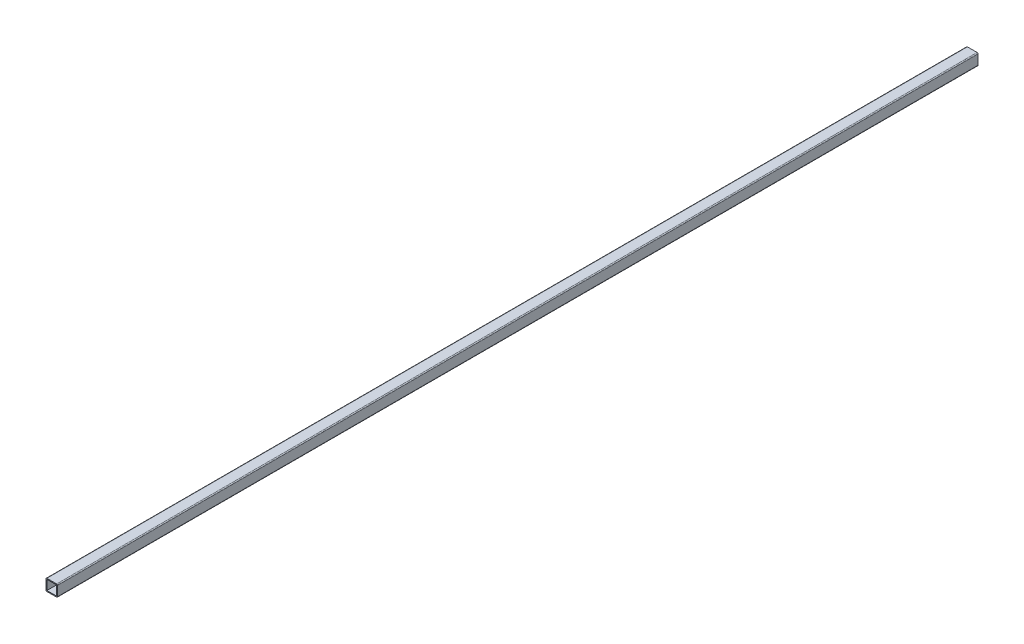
ISO-10303-21;
HEADER;
FILE_DESCRIPTION(('STEP AP214'),'2;1');
FILE_NAME('part.step','',(''),(''),'','','');
FILE_SCHEMA(('AUTOMOTIVE_DESIGN { 1 0 10303 214 1 1 1 1 }'));
ENDSEC;
DATA;
#1=APPLICATION_CONTEXT('core data for automotive mechanical design processes');
#2=APPLICATION_PROTOCOL_DEFINITION('international standard','automotive_design',2000,#1);
#3=PRODUCT_CONTEXT('',#1,'mechanical');
#4=PRODUCT('Part','Part','',(#3));
#5=PRODUCT_RELATED_PRODUCT_CATEGORY('part','',(#4));
#6=PRODUCT_DEFINITION_FORMATION('','',#4);
#7=PRODUCT_DEFINITION_CONTEXT('part definition',#1,'design');
#8=PRODUCT_DEFINITION('design','',#6,#7);
#9=PRODUCT_DEFINITION_SHAPE('','',#8);
#10=(LENGTH_UNIT() NAMED_UNIT(*) SI_UNIT(.MILLI.,.METRE.));
#11=(NAMED_UNIT(*) PLANE_ANGLE_UNIT() SI_UNIT($,.RADIAN.));
#12=(NAMED_UNIT(*) SI_UNIT($,.STERADIAN.) SOLID_ANGLE_UNIT());
#13=UNCERTAINTY_MEASURE_WITH_UNIT(LENGTH_MEASURE(1.E-05),#10,'distance_accuracy_value','');
#14=(GEOMETRIC_REPRESENTATION_CONTEXT(3) GLOBAL_UNCERTAINTY_ASSIGNED_CONTEXT((#13)) GLOBAL_UNIT_ASSIGNED_CONTEXT((#10,
#11,#12)) REPRESENTATION_CONTEXT('',''));
#15=CARTESIAN_POINT('',(0.,0.,0.));
#16=DIRECTION('',(0.,0.,1.));
#17=DIRECTION('',(1.,0.,0.));
#18=AXIS2_PLACEMENT_3D('',#15,#16,#17);
#19=CARTESIAN_POINT('',(-23.,-2.,2000.));
#20=DIRECTION('',(0.,0.,1.));
#21=DIRECTION('',(1.,0.,0.));
#22=AXIS2_PLACEMENT_3D('',#19,#20,#21);
#23=PLANE('',#22);
#24=CARTESIAN_POINT('',(-23.,-2.,2000.));
#25=DIRECTION('',(0.,0.,1.));
#26=DIRECTION('',(1.,0.,0.));
#27=AXIS2_PLACEMENT_3D('',#24,#25,#26);
#28=CIRCLE('',#27,2.);
#29=CARTESIAN_POINT('',(-23.,0.,2000.));
#30=VERTEX_POINT('',#29);
#31=CARTESIAN_POINT('',(-25.,-2.,2000.));
#32=VERTEX_POINT('',#31);
#33=EDGE_CURVE('E159',#30,#32,#28,.T.);
#34=ORIENTED_EDGE('',*,*,#33,.T.);
#35=DIRECTION('',(0.,-1.,0.));
#36=VECTOR('',#35,1.);
#37=CARTESIAN_POINT('',(-25.,-2.,2000.));
#38=LINE('',#37,#36);
#39=CARTESIAN_POINT('',(-25.,-23.,2000.));
#40=VERTEX_POINT('',#39);
#41=EDGE_CURVE('E162',#32,#40,#38,.T.);
#42=ORIENTED_EDGE('',*,*,#41,.T.);
#43=CARTESIAN_POINT('',(-23.,-23.,2000.));
#44=DIRECTION('',(0.,0.,1.));
#45=DIRECTION('',(-1.,0.,0.));
#46=AXIS2_PLACEMENT_3D('',#43,#44,#45);
#47=CIRCLE('',#46,2.);
#48=CARTESIAN_POINT('',(-23.,-25.,2000.));
#49=VERTEX_POINT('',#48);
#50=EDGE_CURVE('E165',#40,#49,#47,.T.);
#51=ORIENTED_EDGE('',*,*,#50,.T.);
#52=DIRECTION('',(1.,0.,0.));
#53=VECTOR('',#52,1.);
#54=CARTESIAN_POINT('',(-2.,-25.,2000.));
#55=LINE('',#54,#53);
#56=CARTESIAN_POINT('',(-2.,-25.,2000.));
#57=VERTEX_POINT('',#56);
#58=EDGE_CURVE('E167',#49,#57,#55,.T.);
#59=ORIENTED_EDGE('',*,*,#58,.T.);
#60=CARTESIAN_POINT('',(-2.,-23.,2000.));
#61=DIRECTION('',(0.,0.,1.));
#62=DIRECTION('',(-1.,0.,0.));
#63=AXIS2_PLACEMENT_3D('',#60,#61,#62);
#64=CIRCLE('',#63,2.);
#65=CARTESIAN_POINT('',(0.,-23.,2000.));
#66=VERTEX_POINT('',#65);
#67=EDGE_CURVE('E169',#57,#66,#64,.T.);
#68=ORIENTED_EDGE('',*,*,#67,.T.);
#69=DIRECTION('',(0.,1.,0.));
#70=VECTOR('',#69,1.);
#71=CARTESIAN_POINT('',(0.,-2.00000000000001,2000.));
#72=LINE('',#71,#70);
#73=CARTESIAN_POINT('',(0.,-2.00000000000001,2000.));
#74=VERTEX_POINT('',#73);
#75=EDGE_CURVE('E171',#66,#74,#72,.T.);
#76=ORIENTED_EDGE('',*,*,#75,.T.);
#77=CARTESIAN_POINT('',(-2.,-2.,2000.));
#78=DIRECTION('',(0.,0.,1.));
#79=DIRECTION('',(-1.,0.,0.));
#80=AXIS2_PLACEMENT_3D('',#77,#78,#79);
#81=CIRCLE('',#80,2.);
#82=CARTESIAN_POINT('',(-2.00000000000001,0.,2000.));
#83=VERTEX_POINT('',#82);
#84=EDGE_CURVE('E173',#74,#83,#81,.T.);
#85=ORIENTED_EDGE('',*,*,#84,.T.);
#86=DIRECTION('',(-1.,0.,0.));
#87=VECTOR('',#86,1.);
#88=CARTESIAN_POINT('',(-2.00000000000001,0.,2000.));
#89=LINE('',#88,#87);
#90=EDGE_CURVE('E175',#83,#30,#89,.T.);
#91=ORIENTED_EDGE('',*,*,#90,.T.);
#92=EDGE_LOOP('',(#34,#42,#51,#59,#68,#76,#85,#91));
#93=FACE_BOUND('',#92,.T.);
#94=DIRECTION('',(-1.,0.,0.));
#95=VECTOR('',#94,1.);
#96=CARTESIAN_POINT('',(-2.00000000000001,-2.,2000.));
#97=LINE('',#96,#95);
#98=CARTESIAN_POINT('',(-2.00000000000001,-2.,2000.));
#99=VERTEX_POINT('',#98);
#100=CARTESIAN_POINT('',(-23.,-2.,2000.));
#101=VERTEX_POINT('',#100);
#102=EDGE_CURVE('E131',#99,#101,#97,.T.);
#103=ORIENTED_EDGE('',*,*,#102,.F.);
#104=DIRECTION('',(0.,1.,0.));
#105=VECTOR('',#104,1.);
#106=CARTESIAN_POINT('',(-2.,-2.00000000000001,2000.));
#107=LINE('',#106,#105);
#108=CARTESIAN_POINT('',(-2.,-23.,2000.));
#109=VERTEX_POINT('',#108);
#110=EDGE_CURVE('E123',#109,#99,#107,.T.);
#111=ORIENTED_EDGE('',*,*,#110,.F.);
#112=DIRECTION('',(1.,0.,0.));
#113=VECTOR('',#112,1.);
#114=CARTESIAN_POINT('',(-2.,-23.,2000.));
#115=LINE('',#114,#113);
#116=CARTESIAN_POINT('',(-23.,-23.,2000.));
#117=VERTEX_POINT('',#116);
#118=EDGE_CURVE('E145',#117,#109,#115,.T.);
#119=ORIENTED_EDGE('',*,*,#118,.F.);
#120=DIRECTION('',(0.,-1.,0.));
#121=VECTOR('',#120,1.);
#122=CARTESIAN_POINT('',(-23.,-2.,2000.));
#123=LINE('',#122,#121);
#124=EDGE_CURVE('E143',#101,#117,#123,.T.);
#125=ORIENTED_EDGE('',*,*,#124,.F.);
#126=EDGE_LOOP('',(#103,#111,#119,#125));
#127=FACE_BOUND('',#126,.T.);
#128=ADVANCED_FACE('F34',(#93,#127),#23,.T.);
#129=CARTESIAN_POINT('',(-23.,-2.,0.));
#130=DIRECTION('',(0.,0.,1.));
#131=DIRECTION('',(1.,0.,0.));
#132=AXIS2_PLACEMENT_3D('',#129,#130,#131);
#133=PLANE('',#132);
#134=CARTESIAN_POINT('',(-23.,-2.,0.));
#135=DIRECTION('',(0.,0.,1.));
#136=DIRECTION('',(1.,0.,0.));
#137=AXIS2_PLACEMENT_3D('',#134,#135,#136);
#138=CIRCLE('',#137,2.);
#139=CARTESIAN_POINT('',(-23.,0.,0.));
#140=VERTEX_POINT('',#139);
#141=CARTESIAN_POINT('',(-25.,-2.,0.));
#142=VERTEX_POINT('',#141);
#143=EDGE_CURVE('E139',#140,#142,#138,.T.);
#144=ORIENTED_EDGE('',*,*,#143,.F.);
#145=DIRECTION('',(-1.,0.,0.));
#146=VECTOR('',#145,1.);
#147=CARTESIAN_POINT('',(-2.00000000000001,0.,0.));
#148=LINE('',#147,#146);
#149=CARTESIAN_POINT('',(-2.00000000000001,0.,0.));
#150=VERTEX_POINT('',#149);
#151=EDGE_CURVE('E163',#150,#140,#148,.T.);
#152=ORIENTED_EDGE('',*,*,#151,.F.);
#153=CARTESIAN_POINT('',(-2.,-2.,0.));
#154=DIRECTION('',(0.,0.,1.));
#155=DIRECTION('',(-1.,0.,0.));
#156=AXIS2_PLACEMENT_3D('',#153,#154,#155);
#157=CIRCLE('',#156,2.);
#158=CARTESIAN_POINT('',(0.,-2.00000000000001,0.));
#159=VERTEX_POINT('',#158);
#160=EDGE_CURVE('E190',#159,#150,#157,.T.);
#161=ORIENTED_EDGE('',*,*,#160,.F.);
#162=DIRECTION('',(0.,1.,0.));
#163=VECTOR('',#162,1.);
#164=CARTESIAN_POINT('',(0.,-2.00000000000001,0.));
#165=LINE('',#164,#163);
#166=CARTESIAN_POINT('',(0.,-23.,0.));
#167=VERTEX_POINT('',#166);
#168=EDGE_CURVE('E188',#167,#159,#165,.T.);
#169=ORIENTED_EDGE('',*,*,#168,.F.);
#170=CARTESIAN_POINT('',(-2.,-23.,0.));
#171=DIRECTION('',(0.,0.,1.));
#172=DIRECTION('',(-1.,0.,0.));
#173=AXIS2_PLACEMENT_3D('',#170,#171,#172);
#174=CIRCLE('',#173,2.);
#175=CARTESIAN_POINT('',(-2.,-25.,0.));
#176=VERTEX_POINT('',#175);
#177=EDGE_CURVE('E186',#176,#167,#174,.T.);
#178=ORIENTED_EDGE('',*,*,#177,.F.);
#179=DIRECTION('',(1.,0.,0.));
#180=VECTOR('',#179,1.);
#181=CARTESIAN_POINT('',(-2.,-25.,0.));
#182=LINE('',#181,#180);
#183=CARTESIAN_POINT('',(-23.,-25.,0.));
#184=VERTEX_POINT('',#183);
#185=EDGE_CURVE('E184',#184,#176,#182,.T.);
#186=ORIENTED_EDGE('',*,*,#185,.F.);
#187=CARTESIAN_POINT('',(-23.,-23.,0.));
#188=DIRECTION('',(0.,0.,1.));
#189=DIRECTION('',(-1.,0.,0.));
#190=AXIS2_PLACEMENT_3D('',#187,#188,#189);
#191=CIRCLE('',#190,2.);
#192=CARTESIAN_POINT('',(-25.,-23.,0.));
#193=VERTEX_POINT('',#192);
#194=EDGE_CURVE('E182',#193,#184,#191,.T.);
#195=ORIENTED_EDGE('',*,*,#194,.F.);
#196=DIRECTION('',(0.,-1.,0.));
#197=VECTOR('',#196,1.);
#198=CARTESIAN_POINT('',(-25.,-2.,0.));
#199=LINE('',#198,#197);
#200=EDGE_CURVE('E180',#142,#193,#199,.T.);
#201=ORIENTED_EDGE('',*,*,#200,.F.);
#202=EDGE_LOOP('',(#144,#152,#161,#169,#178,#186,#195,#201));
#203=FACE_BOUND('',#202,.T.);
#204=DIRECTION('',(0.,1.,0.));
#205=VECTOR('',#204,1.);
#206=CARTESIAN_POINT('',(-2.,-2.00000000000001,0.));
#207=LINE('',#206,#205);
#208=CARTESIAN_POINT('',(-2.,-23.,0.));
#209=VERTEX_POINT('',#208);
#210=CARTESIAN_POINT('',(-2.00000000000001,-2.,0.));
#211=VERTEX_POINT('',#210);
#212=EDGE_CURVE('E57',#209,#211,#207,.T.);
#213=ORIENTED_EDGE('',*,*,#212,.T.);
#214=DIRECTION('',(-1.,0.,0.));
#215=VECTOR('',#214,1.);
#216=CARTESIAN_POINT('',(-2.00000000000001,-2.,0.));
#217=LINE('',#216,#215);
#218=CARTESIAN_POINT('',(-23.,-2.,0.));
#219=VERTEX_POINT('',#218);
#220=EDGE_CURVE('E138',#211,#219,#217,.T.);
#221=ORIENTED_EDGE('',*,*,#220,.T.);
#222=DIRECTION('',(0.,-1.,0.));
#223=VECTOR('',#222,1.);
#224=CARTESIAN_POINT('',(-23.,-2.,0.));
#225=LINE('',#224,#223);
#226=CARTESIAN_POINT('',(-23.,-23.,0.));
#227=VERTEX_POINT('',#226);
#228=EDGE_CURVE('E151',#219,#227,#225,.T.);
#229=ORIENTED_EDGE('',*,*,#228,.T.);
#230=DIRECTION('',(1.,0.,0.));
#231=VECTOR('',#230,1.);
#232=CARTESIAN_POINT('',(-2.,-23.,0.));
#233=LINE('',#232,#231);
#234=EDGE_CURVE('E132',#227,#209,#233,.T.);
#235=ORIENTED_EDGE('',*,*,#234,.T.);
#236=EDGE_LOOP('',(#213,#221,#229,#235));
#237=FACE_BOUND('',#236,.T.);
#238=ADVANCED_FACE('F220',(#203,#237),#133,.F.);
#239=CARTESIAN_POINT('',(-23.,-2.,2000.));
#240=DIRECTION('',(0.,0.,-1.));
#241=DIRECTION('',(-1.,0.,0.));
#242=AXIS2_PLACEMENT_3D('',#239,#240,#241);
#243=CYLINDRICAL_SURFACE('',#242,2.);
#244=ORIENTED_EDGE('',*,*,#143,.T.);
#245=DIRECTION('',(0.,0.,-1.));
#246=VECTOR('',#245,1.);
#247=CARTESIAN_POINT('',(-25.,-2.,2000.));
#248=LINE('',#247,#246);
#249=EDGE_CURVE('E11',#32,#142,#248,.T.);
#250=ORIENTED_EDGE('',*,*,#249,.F.);
#251=ORIENTED_EDGE('',*,*,#33,.F.);
#252=DIRECTION('',(0.,0.,-1.));
#253=VECTOR('',#252,1.);
#254=CARTESIAN_POINT('',(-23.,0.,2000.));
#255=LINE('',#254,#253);
#256=EDGE_CURVE('E177',#30,#140,#255,.T.);
#257=ORIENTED_EDGE('',*,*,#256,.T.);
#258=EDGE_LOOP('',(#244,#250,#251,#257));
#259=FACE_BOUND('',#258,.T.);
#260=ADVANCED_FACE('F36',(#259),#243,.T.);
#261=CARTESIAN_POINT('',(-25.,-2.,2000.));
#262=DIRECTION('',(1.,0.,0.));
#263=DIRECTION('',(0.,1.,0.));
#264=AXIS2_PLACEMENT_3D('',#261,#262,#263);
#265=PLANE('',#264);
#266=ORIENTED_EDGE('',*,*,#200,.T.);
#267=DIRECTION('',(0.,0.,-1.));
#268=VECTOR('',#267,1.);
#269=CARTESIAN_POINT('',(-25.,-23.,2000.));
#270=LINE('',#269,#268);
#271=EDGE_CURVE('E42',#40,#193,#270,.T.);
#272=ORIENTED_EDGE('',*,*,#271,.F.);
#273=ORIENTED_EDGE('',*,*,#41,.F.);
#274=ORIENTED_EDGE('',*,*,#249,.T.);
#275=EDGE_LOOP('',(#266,#272,#273,#274));
#276=FACE_BOUND('',#275,.T.);
#277=ADVANCED_FACE('F237',(#276),#265,.F.);
#278=CARTESIAN_POINT('',(-23.,-23.,2000.));
#279=DIRECTION('',(0.,0.,-1.));
#280=DIRECTION('',(-1.,0.,0.));
#281=AXIS2_PLACEMENT_3D('',#278,#279,#280);
#282=CYLINDRICAL_SURFACE('',#281,2.);
#283=ORIENTED_EDGE('',*,*,#194,.T.);
#284=DIRECTION('',(0.,0.,-1.));
#285=VECTOR('',#284,1.);
#286=CARTESIAN_POINT('',(-23.,-25.,2000.));
#287=LINE('',#286,#285);
#288=EDGE_CURVE('E207',#49,#184,#287,.T.);
#289=ORIENTED_EDGE('',*,*,#288,.F.);
#290=ORIENTED_EDGE('',*,*,#50,.F.);
#291=ORIENTED_EDGE('',*,*,#271,.T.);
#292=EDGE_LOOP('',(#283,#289,#290,#291));
#293=FACE_BOUND('',#292,.T.);
#294=ADVANCED_FACE('F214',(#293),#282,.T.);
#295=CARTESIAN_POINT('',(-2.,-25.,2000.));
#296=DIRECTION('',(0.,1.,0.));
#297=DIRECTION('',(-1.,0.,0.));
#298=AXIS2_PLACEMENT_3D('',#295,#296,#297);
#299=PLANE('',#298);
#300=ORIENTED_EDGE('',*,*,#185,.T.);
#301=DIRECTION('',(0.,0.,-1.));
#302=VECTOR('',#301,1.);
#303=CARTESIAN_POINT('',(-2.,-25.,2000.));
#304=LINE('',#303,#302);
#305=EDGE_CURVE('E204',#57,#176,#304,.T.);
#306=ORIENTED_EDGE('',*,*,#305,.F.);
#307=ORIENTED_EDGE('',*,*,#58,.F.);
#308=ORIENTED_EDGE('',*,*,#288,.T.);
#309=EDGE_LOOP('',(#300,#306,#307,#308));
#310=FACE_BOUND('',#309,.T.);
#311=ADVANCED_FACE('F226',(#310),#299,.F.);
#312=CARTESIAN_POINT('',(-2.,-23.,2000.));
#313=DIRECTION('',(0.,0.,-1.));
#314=DIRECTION('',(-1.,0.,0.));
#315=AXIS2_PLACEMENT_3D('',#312,#313,#314);
#316=CYLINDRICAL_SURFACE('',#315,2.);
#317=ORIENTED_EDGE('',*,*,#177,.T.);
#318=DIRECTION('',(0.,0.,-1.));
#319=VECTOR('',#318,1.);
#320=CARTESIAN_POINT('',(0.,-23.,2000.));
#321=LINE('',#320,#319);
#322=EDGE_CURVE('E201',#66,#167,#321,.T.);
#323=ORIENTED_EDGE('',*,*,#322,.F.);
#324=ORIENTED_EDGE('',*,*,#67,.F.);
#325=ORIENTED_EDGE('',*,*,#305,.T.);
#326=EDGE_LOOP('',(#317,#323,#324,#325));
#327=FACE_BOUND('',#326,.T.);
#328=ADVANCED_FACE('F230',(#327),#316,.T.);
#329=CARTESIAN_POINT('',(0.,-2.00000000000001,2000.));
#330=DIRECTION('',(-1.,0.,0.));
#331=DIRECTION('',(0.,-1.,0.));
#332=AXIS2_PLACEMENT_3D('',#329,#330,#331);
#333=PLANE('',#332);
#334=ORIENTED_EDGE('',*,*,#168,.T.);
#335=DIRECTION('',(0.,0.,-1.));
#336=VECTOR('',#335,1.);
#337=CARTESIAN_POINT('',(0.,-2.00000000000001,2000.));
#338=LINE('',#337,#336);
#339=EDGE_CURVE('E198',#74,#159,#338,.T.);
#340=ORIENTED_EDGE('',*,*,#339,.F.);
#341=ORIENTED_EDGE('',*,*,#75,.F.);
#342=ORIENTED_EDGE('',*,*,#322,.T.);
#343=EDGE_LOOP('',(#334,#340,#341,#342));
#344=FACE_BOUND('',#343,.T.);
#345=ADVANCED_FACE('F250',(#344),#333,.F.);
#346=CARTESIAN_POINT('',(-2.,-2.,2000.));
#347=DIRECTION('',(0.,0.,-1.));
#348=DIRECTION('',(-1.,0.,0.));
#349=AXIS2_PLACEMENT_3D('',#346,#347,#348);
#350=CYLINDRICAL_SURFACE('',#349,2.);
#351=ORIENTED_EDGE('',*,*,#160,.T.);
#352=DIRECTION('',(0.,0.,-1.));
#353=VECTOR('',#352,1.);
#354=CARTESIAN_POINT('',(-2.00000000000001,0.,2000.));
#355=LINE('',#354,#353);
#356=EDGE_CURVE('E195',#83,#150,#355,.T.);
#357=ORIENTED_EDGE('',*,*,#356,.F.);
#358=ORIENTED_EDGE('',*,*,#84,.F.);
#359=ORIENTED_EDGE('',*,*,#339,.T.);
#360=EDGE_LOOP('',(#351,#357,#358,#359));
#361=FACE_BOUND('',#360,.T.);
#362=ADVANCED_FACE('F248',(#361),#350,.T.);
#363=CARTESIAN_POINT('',(-2.00000000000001,0.,2000.));
#364=DIRECTION('',(0.,-1.,0.));
#365=DIRECTION('',(1.,0.,0.));
#366=AXIS2_PLACEMENT_3D('',#363,#364,#365);
#367=PLANE('',#366);
#368=ORIENTED_EDGE('',*,*,#151,.T.);
#369=ORIENTED_EDGE('',*,*,#256,.F.);
#370=ORIENTED_EDGE('',*,*,#90,.F.);
#371=ORIENTED_EDGE('',*,*,#356,.T.);
#372=EDGE_LOOP('',(#368,#369,#370,#371));
#373=FACE_BOUND('',#372,.T.);
#374=ADVANCED_FACE('F243',(#373),#367,.F.);
#375=CARTESIAN_POINT('',(-2.,-2.00000000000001,2000.));
#376=DIRECTION('',(-1.,0.,0.));
#377=DIRECTION('',(0.,-1.,0.));
#378=AXIS2_PLACEMENT_3D('',#375,#376,#377);
#379=PLANE('',#378);
#380=ORIENTED_EDGE('',*,*,#212,.F.);
#381=DIRECTION('',(0.,0.,-1.));
#382=VECTOR('',#381,1.);
#383=CARTESIAN_POINT('',(-2.,-23.,2000.));
#384=LINE('',#383,#382);
#385=EDGE_CURVE('E127',#109,#209,#384,.T.);
#386=ORIENTED_EDGE('',*,*,#385,.F.);
#387=ORIENTED_EDGE('',*,*,#110,.T.);
#388=DIRECTION('',(0.,0.,-1.));
#389=VECTOR('',#388,1.);
#390=CARTESIAN_POINT('',(-2.00000000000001,-2.,2000.));
#391=LINE('',#390,#389);
#392=EDGE_CURVE('E126',#99,#211,#391,.T.);
#393=ORIENTED_EDGE('',*,*,#392,.T.);
#394=EDGE_LOOP('',(#380,#386,#387,#393));
#395=FACE_BOUND('',#394,.T.);
#396=ADVANCED_FACE('F125',(#395),#379,.T.);
#397=CARTESIAN_POINT('',(-2.00000000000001,-2.,2000.));
#398=DIRECTION('',(0.,-1.,0.));
#399=DIRECTION('',(1.,0.,0.));
#400=AXIS2_PLACEMENT_3D('',#397,#398,#399);
#401=PLANE('',#400);
#402=ORIENTED_EDGE('',*,*,#220,.F.);
#403=ORIENTED_EDGE('',*,*,#392,.F.);
#404=ORIENTED_EDGE('',*,*,#102,.T.);
#405=DIRECTION('',(0.,0.,-1.));
#406=VECTOR('',#405,1.);
#407=CARTESIAN_POINT('',(-23.,-2.,2000.));
#408=LINE('',#407,#406);
#409=EDGE_CURVE('E140',#101,#219,#408,.T.);
#410=ORIENTED_EDGE('',*,*,#409,.T.);
#411=EDGE_LOOP('',(#402,#403,#404,#410));
#412=FACE_BOUND('',#411,.T.);
#413=ADVANCED_FACE('F135',(#412),#401,.T.);
#414=CARTESIAN_POINT('',(-23.,-2.,2000.));
#415=DIRECTION('',(1.,0.,0.));
#416=DIRECTION('',(0.,0.,-1.));
#417=AXIS2_PLACEMENT_3D('',#414,#415,#416);
#418=PLANE('',#417);
#419=ORIENTED_EDGE('',*,*,#228,.F.);
#420=ORIENTED_EDGE('',*,*,#409,.F.);
#421=ORIENTED_EDGE('',*,*,#124,.T.);
#422=DIRECTION('',(0.,0.,-1.));
#423=VECTOR('',#422,1.);
#424=CARTESIAN_POINT('',(-23.,-23.,2000.));
#425=LINE('',#424,#423);
#426=EDGE_CURVE('E49',#117,#227,#425,.T.);
#427=ORIENTED_EDGE('',*,*,#426,.T.);
#428=EDGE_LOOP('',(#419,#420,#421,#427));
#429=FACE_BOUND('',#428,.T.);
#430=ADVANCED_FACE('F275',(#429),#418,.T.);
#431=CARTESIAN_POINT('',(-2.,-23.,2000.));
#432=DIRECTION('',(0.,1.,0.));
#433=DIRECTION('',(-1.,0.,0.));
#434=AXIS2_PLACEMENT_3D('',#431,#432,#433);
#435=PLANE('',#434);
#436=ORIENTED_EDGE('',*,*,#234,.F.);
#437=ORIENTED_EDGE('',*,*,#426,.F.);
#438=ORIENTED_EDGE('',*,*,#118,.T.);
#439=ORIENTED_EDGE('',*,*,#385,.T.);
#440=EDGE_LOOP('',(#436,#437,#438,#439));
#441=FACE_BOUND('',#440,.T.);
#442=ADVANCED_FACE('F279',(#441),#435,.T.);
#443=CLOSED_SHELL('',(#128,#238,#260,#277,#294,#311,#328,#345,#362,#374,#396,#413,#430,#442));
#444=MANIFOLD_SOLID_BREP('B2',#443);
#445=ADVANCED_BREP_SHAPE_REPRESENTATION('',(#18,#444),#14);
#446=SHAPE_DEFINITION_REPRESENTATION(#9,#445);
ENDSEC;
END-ISO-10303-21;
